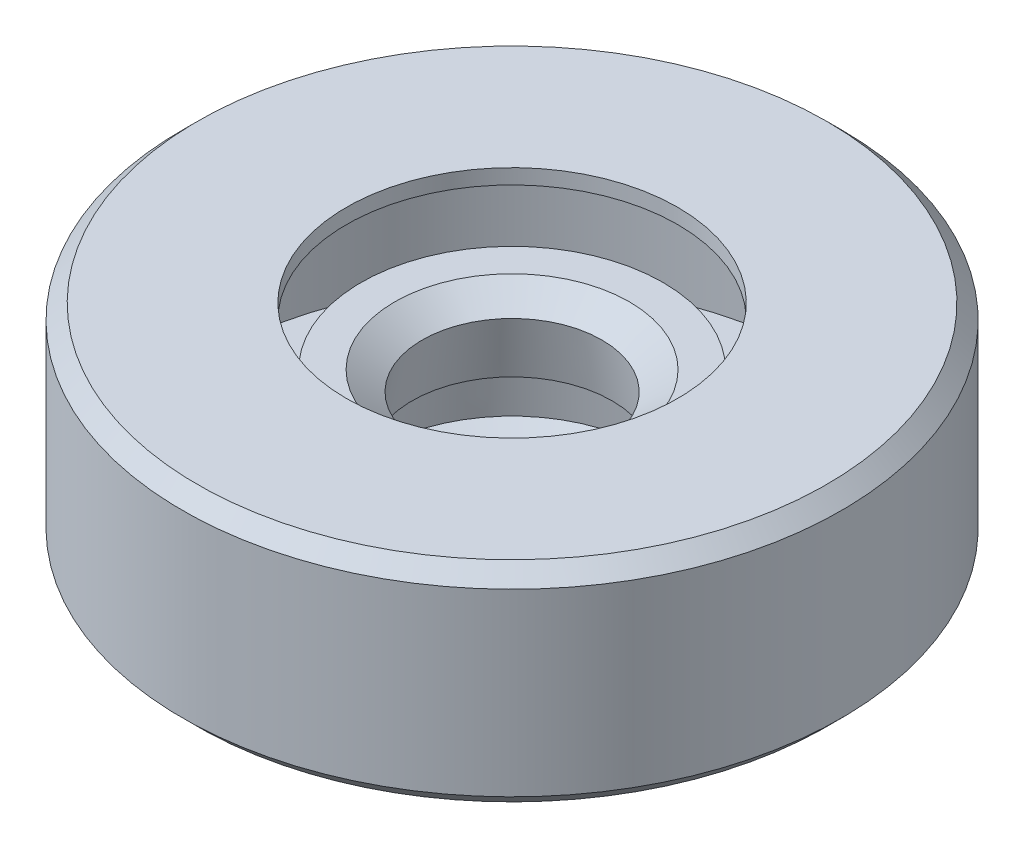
ISO-10303-21;
HEADER;
FILE_DESCRIPTION(('STEP AP214'),'2;1');
FILE_NAME('part.step','',(''),(''),'','','');
FILE_SCHEMA(('AUTOMOTIVE_DESIGN { 1 0 10303 214 1 1 1 1 }'));
ENDSEC;
DATA;
#1=APPLICATION_CONTEXT('core data for automotive mechanical design processes');
#2=APPLICATION_PROTOCOL_DEFINITION('international standard','automotive_design',2000,#1);
#3=PRODUCT_CONTEXT('',#1,'mechanical');
#4=PRODUCT('Part','Part','',(#3));
#5=PRODUCT_RELATED_PRODUCT_CATEGORY('part','',(#4));
#6=PRODUCT_DEFINITION_FORMATION('','',#4);
#7=PRODUCT_DEFINITION_CONTEXT('part definition',#1,'design');
#8=PRODUCT_DEFINITION('design','',#6,#7);
#9=PRODUCT_DEFINITION_SHAPE('','',#8);
#10=(LENGTH_UNIT() NAMED_UNIT(*) SI_UNIT(.MILLI.,.METRE.));
#11=(NAMED_UNIT(*) PLANE_ANGLE_UNIT() SI_UNIT($,.RADIAN.));
#12=(NAMED_UNIT(*) SI_UNIT($,.STERADIAN.) SOLID_ANGLE_UNIT());
#13=UNCERTAINTY_MEASURE_WITH_UNIT(LENGTH_MEASURE(1.E-05),#10,'distance_accuracy_value','');
#14=(GEOMETRIC_REPRESENTATION_CONTEXT(3) GLOBAL_UNCERTAINTY_ASSIGNED_CONTEXT((#13)) GLOBAL_UNIT_ASSIGNED_CONTEXT((#10,
#11,#12)) REPRESENTATION_CONTEXT('',''));
#15=CARTESIAN_POINT('',(0.,0.,0.));
#16=DIRECTION('',(0.,0.,1.));
#17=DIRECTION('',(1.,0.,0.));
#18=AXIS2_PLACEMENT_3D('',#15,#16,#17);
#19=CARTESIAN_POINT('',(0.,3.55064134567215,0.));
#20=DIRECTION('',(0.,-1.,0.));
#21=DIRECTION('',(0.,0.,-1.));
#22=AXIS2_PLACEMENT_3D('',#19,#20,#21);
#23=TOROIDAL_SURFACE('',#22,4.83888237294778,0.447213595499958);
#24=CARTESIAN_POINT('',(0.,3.1034277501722,0.));
#25=DIRECTION('',(0.,-1.,0.));
#26=DIRECTION('',(0.,0.,-1.));
#27=AXIS2_PLACEMENT_3D('',#24,#25,#26);
#28=CIRCLE('',#27,4.83888237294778);
#29=CARTESIAN_POINT('',(0.,3.1034277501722,-4.83888237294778));
#30=VERTEX_POINT('',#29);
#31=EDGE_CURVE('E10',#30,#30,#28,.T.);
#32=ORIENTED_EDGE('',*,*,#31,.F.);
#33=EDGE_LOOP('',(#32));
#34=FACE_BOUND('',#33,.T.);
#35=CARTESIAN_POINT('',(0.,3.95064134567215,0.));
#36=DIRECTION('',(0.,-1.,0.));
#37=DIRECTION('',(0.,0.,-1.));
#38=AXIS2_PLACEMENT_3D('',#35,#36,#37);
#39=CIRCLE('',#38,5.03888237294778);
#40=CARTESIAN_POINT('',(0.,3.95064134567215,-5.03888237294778));
#41=VERTEX_POINT('',#40);
#42=EDGE_CURVE('E99',#41,#41,#39,.T.);
#43=ORIENTED_EDGE('',*,*,#42,.T.);
#44=EDGE_LOOP('',(#43));
#45=FACE_BOUND('',#44,.T.);
#46=ADVANCED_FACE('F29',(#34,#45),#23,.T.);
#47=CARTESIAN_POINT('',(0.,3.1034277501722,0.));
#48=DIRECTION('',(0.,-1.,0.));
#49=DIRECTION('',(0.,0.,-1.));
#50=AXIS2_PLACEMENT_3D('',#47,#48,#49);
#51=CONICAL_SURFACE('',#50,4.83888237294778,0.0872664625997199);
#52=CARTESIAN_POINT('',(0.,0.933012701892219,0.));
#53=DIRECTION('',(0.,-1.,0.));
#54=DIRECTION('',(0.,0.,-1.));
#55=AXIS2_PLACEMENT_3D('',#52,#53,#54);
#56=CIRCLE('',#55,5.02876908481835);
#57=CARTESIAN_POINT('',(0.,0.933012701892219,-5.02876908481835));
#58=VERTEX_POINT('',#57);
#59=EDGE_CURVE('E35',#58,#58,#56,.T.);
#60=ORIENTED_EDGE('',*,*,#59,.F.);
#61=EDGE_LOOP('',(#60));
#62=FACE_BOUND('',#61,.T.);
#63=ORIENTED_EDGE('',*,*,#31,.T.);
#64=EDGE_LOOP('',(#63));
#65=FACE_BOUND('',#64,.T.);
#66=ADVANCED_FACE('F220',(#62,#65),#51,.T.);
#67=CARTESIAN_POINT('',(-5.52876908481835,0.933012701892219,0.));
#68=DIRECTION('',(0.,-1.,0.));
#69=DIRECTION('',(0.,0.,-1.));
#70=AXIS2_PLACEMENT_3D('',#67,#68,#69);
#71=PLANE('',#70);
#72=CARTESIAN_POINT('',(0.,0.933012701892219,0.));
#73=DIRECTION('',(0.,-1.,0.));
#74=DIRECTION('',(0.,0.,-1.));
#75=AXIS2_PLACEMENT_3D('',#72,#73,#74);
#76=CIRCLE('',#75,5.52876908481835);
#77=CARTESIAN_POINT('',(0.,0.933012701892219,-5.52876908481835));
#78=VERTEX_POINT('',#77);
#79=EDGE_CURVE('E39',#78,#78,#76,.T.);
#80=ORIENTED_EDGE('',*,*,#79,.F.);
#81=EDGE_LOOP('',(#80));
#82=FACE_BOUND('',#81,.T.);
#83=ORIENTED_EDGE('',*,*,#59,.T.);
#84=EDGE_LOOP('',(#83));
#85=FACE_BOUND('',#84,.T.);
#86=ADVANCED_FACE('F215',(#82,#85),#71,.F.);
#87=CARTESIAN_POINT('',(0.,0.933012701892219,0.));
#88=DIRECTION('',(0.,-1.,0.));
#89=DIRECTION('',(0.,0.,-1.));
#90=AXIS2_PLACEMENT_3D('',#87,#88,#89);
#91=CONICAL_SURFACE('',#90,5.52876908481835,0.523598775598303);
#92=CARTESIAN_POINT('',(0.,0.5,0.));
#93=DIRECTION('',(0.,-1.,0.));
#94=DIRECTION('',(0.,0.,-1.));
#95=AXIS2_PLACEMENT_3D('',#92,#93,#94);
#96=CIRCLE('',#95,5.77876908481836);
#97=CARTESIAN_POINT('',(0.,0.5,-5.77876908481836));
#98=VERTEX_POINT('',#97);
#99=EDGE_CURVE('E43',#98,#98,#96,.T.);
#100=ORIENTED_EDGE('',*,*,#99,.F.);
#101=EDGE_LOOP('',(#100));
#102=FACE_BOUND('',#101,.T.);
#103=ORIENTED_EDGE('',*,*,#79,.T.);
#104=EDGE_LOOP('',(#103));
#105=FACE_BOUND('',#104,.T.);
#106=ADVANCED_FACE('F209',(#102,#105),#91,.T.);
#107=CARTESIAN_POINT('',(-10.,0.5,0.));
#108=DIRECTION('',(0.,-1.,0.));
#109=DIRECTION('',(0.,0.,-1.));
#110=AXIS2_PLACEMENT_3D('',#107,#108,#109);
#111=PLANE('',#110);
#112=CARTESIAN_POINT('',(0.,0.499999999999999,0.));
#113=DIRECTION('',(0.,-1.,0.));
#114=DIRECTION('',(0.,0.,-1.));
#115=AXIS2_PLACEMENT_3D('',#112,#113,#114);
#116=CIRCLE('',#115,10.);
#117=CARTESIAN_POINT('',(0.,0.499999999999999,-10.));
#118=VERTEX_POINT('',#117);
#119=EDGE_CURVE('E48',#118,#118,#116,.T.);
#120=ORIENTED_EDGE('',*,*,#119,.F.);
#121=EDGE_LOOP('',(#120));
#122=FACE_BOUND('',#121,.T.);
#123=ORIENTED_EDGE('',*,*,#99,.T.);
#124=EDGE_LOOP('',(#123));
#125=FACE_BOUND('',#124,.T.);
#126=ADVANCED_FACE('F203',(#122,#125),#111,.F.);
#127=CARTESIAN_POINT('',(0.,0.,0.));
#128=DIRECTION('',(0.,-1.,0.));
#129=DIRECTION('',(0.,0.,-1.));
#130=AXIS2_PLACEMENT_3D('',#127,#128,#129);
#131=CYLINDRICAL_SURFACE('',#130,10.);
#132=CARTESIAN_POINT('',(0.,6.5,0.));
#133=DIRECTION('',(0.,-1.,0.));
#134=DIRECTION('',(0.,0.,-1.));
#135=AXIS2_PLACEMENT_3D('',#132,#133,#134);
#136=CIRCLE('',#135,10.);
#137=CARTESIAN_POINT('',(0.,6.5,-10.));
#138=VERTEX_POINT('',#137);
#139=EDGE_CURVE('E51',#138,#138,#136,.T.);
#140=ORIENTED_EDGE('',*,*,#139,.F.);
#141=EDGE_LOOP('',(#140));
#142=FACE_BOUND('',#141,.T.);
#143=ORIENTED_EDGE('',*,*,#119,.T.);
#144=EDGE_LOOP('',(#143));
#145=FACE_BOUND('',#144,.T.);
#146=ADVANCED_FACE('F197',(#142,#145),#131,.F.);
#147=CARTESIAN_POINT('',(-10.,6.5,0.));
#148=DIRECTION('',(0.,1.,0.));
#149=DIRECTION('',(0.,0.,1.));
#150=AXIS2_PLACEMENT_3D('',#147,#148,#149);
#151=PLANE('',#150);
#152=CARTESIAN_POINT('',(0.,6.5,0.));
#153=DIRECTION('',(0.,-1.,0.));
#154=DIRECTION('',(0.,0.,-1.));
#155=AXIS2_PLACEMENT_3D('',#152,#153,#154);
#156=CIRCLE('',#155,5.52876908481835);
#157=CARTESIAN_POINT('',(0.,6.5,-5.52876908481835));
#158=VERTEX_POINT('',#157);
#159=EDGE_CURVE('E54',#158,#158,#156,.T.);
#160=ORIENTED_EDGE('',*,*,#159,.F.);
#161=EDGE_LOOP('',(#160));
#162=FACE_BOUND('',#161,.T.);
#163=ORIENTED_EDGE('',*,*,#139,.T.);
#164=EDGE_LOOP('',(#163));
#165=FACE_BOUND('',#164,.T.);
#166=ADVANCED_FACE('F191',(#162,#165),#151,.F.);
#167=CARTESIAN_POINT('',(0.,0.,0.));
#168=DIRECTION('',(0.,-1.,0.));
#169=DIRECTION('',(0.,0.,-1.));
#170=AXIS2_PLACEMENT_3D('',#167,#168,#169);
#171=CYLINDRICAL_SURFACE('',#170,5.52876908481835);
#172=CARTESIAN_POINT('',(0.,7.,0.));
#173=DIRECTION('',(0.,-1.,0.));
#174=DIRECTION('',(0.,0.,-1.));
#175=AXIS2_PLACEMENT_3D('',#172,#173,#174);
#176=CIRCLE('',#175,5.52876908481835);
#177=CARTESIAN_POINT('',(0.,7.,-5.52876908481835));
#178=VERTEX_POINT('',#177);
#179=EDGE_CURVE('E57',#178,#178,#176,.T.);
#180=ORIENTED_EDGE('',*,*,#179,.F.);
#181=EDGE_LOOP('',(#180));
#182=FACE_BOUND('',#181,.T.);
#183=ORIENTED_EDGE('',*,*,#159,.T.);
#184=EDGE_LOOP('',(#183));
#185=FACE_BOUND('',#184,.T.);
#186=ADVANCED_FACE('F185',(#182,#185),#171,.F.);
#187=CARTESIAN_POINT('',(-10.5,7.,0.));
#188=DIRECTION('',(0.,-1.,0.));
#189=DIRECTION('',(0.,0.,-1.));
#190=AXIS2_PLACEMENT_3D('',#187,#188,#189);
#191=PLANE('',#190);
#192=CARTESIAN_POINT('',(0.,7.,0.));
#193=DIRECTION('',(0.,-1.,0.));
#194=DIRECTION('',(0.,0.,-1.));
#195=AXIS2_PLACEMENT_3D('',#192,#193,#194);
#196=CIRCLE('',#195,10.5);
#197=CARTESIAN_POINT('',(0.,7.,-10.5));
#198=VERTEX_POINT('',#197);
#199=EDGE_CURVE('E60',#198,#198,#196,.T.);
#200=ORIENTED_EDGE('',*,*,#199,.F.);
#201=EDGE_LOOP('',(#200));
#202=FACE_BOUND('',#201,.T.);
#203=ORIENTED_EDGE('',*,*,#179,.T.);
#204=EDGE_LOOP('',(#203));
#205=FACE_BOUND('',#204,.T.);
#206=ADVANCED_FACE('F179',(#202,#205),#191,.F.);
#207=CARTESIAN_POINT('',(0.,7.,0.));
#208=DIRECTION('',(0.,-1.,0.));
#209=DIRECTION('',(0.,0.,-1.));
#210=AXIS2_PLACEMENT_3D('',#207,#208,#209);
#211=CONICAL_SURFACE('',#210,10.5,0.785398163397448);
#212=CARTESIAN_POINT('',(0.,6.5,0.));
#213=DIRECTION('',(0.,-1.,0.));
#214=DIRECTION('',(0.,0.,-1.));
#215=AXIS2_PLACEMENT_3D('',#212,#213,#214);
#216=CIRCLE('',#215,11.);
#217=CARTESIAN_POINT('',(0.,6.5,-11.));
#218=VERTEX_POINT('',#217);
#219=EDGE_CURVE('E63',#218,#218,#216,.T.);
#220=ORIENTED_EDGE('',*,*,#219,.F.);
#221=EDGE_LOOP('',(#220));
#222=FACE_BOUND('',#221,.T.);
#223=ORIENTED_EDGE('',*,*,#199,.T.);
#224=EDGE_LOOP('',(#223));
#225=FACE_BOUND('',#224,.T.);
#226=ADVANCED_FACE('F173',(#222,#225),#211,.T.);
#227=CARTESIAN_POINT('',(0.,0.,0.));
#228=DIRECTION('',(0.,-1.,0.));
#229=DIRECTION('',(0.,0.,-1.));
#230=AXIS2_PLACEMENT_3D('',#227,#228,#229);
#231=CYLINDRICAL_SURFACE('',#230,11.);
#232=CARTESIAN_POINT('',(0.,0.499999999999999,0.));
#233=DIRECTION('',(0.,-1.,0.));
#234=DIRECTION('',(0.,0.,-1.));
#235=AXIS2_PLACEMENT_3D('',#232,#233,#234);
#236=CIRCLE('',#235,11.);
#237=CARTESIAN_POINT('',(0.,0.499999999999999,-11.));
#238=VERTEX_POINT('',#237);
#239=EDGE_CURVE('E66',#238,#238,#236,.T.);
#240=ORIENTED_EDGE('',*,*,#239,.F.);
#241=EDGE_LOOP('',(#240));
#242=FACE_BOUND('',#241,.T.);
#243=ORIENTED_EDGE('',*,*,#219,.T.);
#244=EDGE_LOOP('',(#243));
#245=FACE_BOUND('',#244,.T.);
#246=ADVANCED_FACE('F167',(#242,#245),#231,.T.);
#247=CARTESIAN_POINT('',(0.,0.499999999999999,0.));
#248=DIRECTION('',(0.,1.,0.));
#249=DIRECTION('',(0.,0.,1.));
#250=AXIS2_PLACEMENT_3D('',#247,#248,#249);
#251=CONICAL_SURFACE('',#250,11.,0.785398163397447);
#252=CARTESIAN_POINT('',(0.,0.,0.));
#253=DIRECTION('',(0.,-1.,0.));
#254=DIRECTION('',(0.,0.,-1.));
#255=AXIS2_PLACEMENT_3D('',#252,#253,#254);
#256=CIRCLE('',#255,10.5);
#257=CARTESIAN_POINT('',(0.,0.,-10.5));
#258=VERTEX_POINT('',#257);
#259=EDGE_CURVE('E69',#258,#258,#256,.T.);
#260=ORIENTED_EDGE('',*,*,#259,.F.);
#261=EDGE_LOOP('',(#260));
#262=FACE_BOUND('',#261,.T.);
#263=ORIENTED_EDGE('',*,*,#239,.T.);
#264=EDGE_LOOP('',(#263));
#265=FACE_BOUND('',#264,.T.);
#266=ADVANCED_FACE('F161',(#262,#265),#251,.T.);
#267=CARTESIAN_POINT('',(-10.5,0.,0.));
#268=DIRECTION('',(0.,1.,0.));
#269=DIRECTION('',(0.,0.,1.));
#270=AXIS2_PLACEMENT_3D('',#267,#268,#269);
#271=PLANE('',#270);
#272=CARTESIAN_POINT('',(0.,0.,0.));
#273=DIRECTION('',(0.,-1.,0.));
#274=DIRECTION('',(0.,0.,-1.));
#275=AXIS2_PLACEMENT_3D('',#272,#273,#274);
#276=CIRCLE('',#275,5.00848720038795);
#277=CARTESIAN_POINT('',(0.,0.,-5.00848720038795));
#278=VERTEX_POINT('',#277);
#279=EDGE_CURVE('E72',#278,#278,#276,.T.);
#280=ORIENTED_EDGE('',*,*,#279,.F.);
#281=EDGE_LOOP('',(#280));
#282=FACE_BOUND('',#281,.T.);
#283=ORIENTED_EDGE('',*,*,#259,.T.);
#284=EDGE_LOOP('',(#283));
#285=FACE_BOUND('',#284,.T.);
#286=ADVANCED_FACE('F155',(#282,#285),#271,.F.);
#287=CARTESIAN_POINT('',(0.,-0.116666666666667,0.));
#288=DIRECTION('',(0.,-1.,0.));
#289=DIRECTION('',(0.,0.,-1.));
#290=AXIS2_PLACEMENT_3D('',#287,#288,#289);
#291=TOROIDAL_SURFACE('',#290,4.60848720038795,0.416666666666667);
#292=CARTESIAN_POINT('',(0.,0.,0.));
#293=DIRECTION('',(0.,-1.,0.));
#294=DIRECTION('',(0.,0.,-1.));
#295=AXIS2_PLACEMENT_3D('',#292,#293,#294);
#296=CIRCLE('',#295,4.20848720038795);
#297=CARTESIAN_POINT('',(0.,0.,-4.20848720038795));
#298=VERTEX_POINT('',#297);
#299=EDGE_CURVE('E75',#298,#298,#296,.T.);
#300=ORIENTED_EDGE('',*,*,#299,.F.);
#301=EDGE_LOOP('',(#300));
#302=FACE_BOUND('',#301,.T.);
#303=ORIENTED_EDGE('',*,*,#279,.T.);
#304=EDGE_LOOP('',(#303));
#305=FACE_BOUND('',#304,.T.);
#306=ADVANCED_FACE('F149',(#302,#305),#291,.F.);
#307=CARTESIAN_POINT('',(0.,0.,0.));
#308=DIRECTION('',(0.,-1.,0.));
#309=DIRECTION('',(0.,0.,-1.));
#310=AXIS2_PLACEMENT_3D('',#307,#308,#309);
#311=CONICAL_SURFACE('',#310,4.20848720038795,1.48352986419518);
#312=CARTESIAN_POINT('',(0.,0.0759776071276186,0.));
#313=DIRECTION('',(0.,-1.,0.));
#314=DIRECTION('',(0.,0.,-1.));
#315=AXIS2_PLACEMENT_3D('',#312,#313,#314);
#316=CIRCLE('',#315,3.34005917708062);
#317=CARTESIAN_POINT('',(0.,0.0759776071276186,-3.34005917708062));
#318=VERTEX_POINT('',#317);
#319=EDGE_CURVE('E78',#318,#318,#316,.T.);
#320=ORIENTED_EDGE('',*,*,#319,.F.);
#321=EDGE_LOOP('',(#320));
#322=FACE_BOUND('',#321,.T.);
#323=ORIENTED_EDGE('',*,*,#299,.T.);
#324=EDGE_LOOP('',(#323));
#325=FACE_BOUND('',#324,.T.);
#326=ADVANCED_FACE('F143',(#322,#325),#311,.F.);
#327=CARTESIAN_POINT('',(0.,0.0759776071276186,0.));
#328=DIRECTION('',(0.,1.,0.));
#329=DIRECTION('',(0.,0.,1.));
#330=AXIS2_PLACEMENT_3D('',#327,#328,#329);
#331=CONICAL_SURFACE('',#330,3.34005917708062,1.23748390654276);
#332=CARTESIAN_POINT('',(0.,0.500000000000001,0.));
#333=DIRECTION('',(0.,-1.,0.));
#334=DIRECTION('',(0.,0.,-1.));
#335=AXIS2_PLACEMENT_3D('',#332,#333,#334);
#336=CIRCLE('',#335,4.56474286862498);
#337=CARTESIAN_POINT('',(0.,0.500000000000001,-4.56474286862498));
#338=VERTEX_POINT('',#337);
#339=EDGE_CURVE('E81',#338,#338,#336,.T.);
#340=ORIENTED_EDGE('',*,*,#339,.F.);
#341=EDGE_LOOP('',(#340));
#342=FACE_BOUND('',#341,.T.);
#343=ORIENTED_EDGE('',*,*,#319,.T.);
#344=EDGE_LOOP('',(#343));
#345=FACE_BOUND('',#344,.T.);
#346=ADVANCED_FACE('F137',(#342,#345),#331,.F.);
#347=CARTESIAN_POINT('',(0.,0.500000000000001,0.));
#348=DIRECTION('',(0.,-1.,0.));
#349=DIRECTION('',(0.,0.,-1.));
#350=AXIS2_PLACEMENT_3D('',#347,#348,#349);
#351=CONICAL_SURFACE('',#350,4.56474286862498,0.0872664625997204);
#352=CARTESIAN_POINT('',(0.,2.5,0.));
#353=DIRECTION('',(0.,-1.,0.));
#354=DIRECTION('',(0.,0.,-1.));
#355=AXIS2_PLACEMENT_3D('',#352,#353,#354);
#356=CIRCLE('',#355,4.38976554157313);
#357=CARTESIAN_POINT('',(0.,2.5,-4.38976554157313));
#358=VERTEX_POINT('',#357);
#359=EDGE_CURVE('E84',#358,#358,#356,.T.);
#360=ORIENTED_EDGE('',*,*,#359,.F.);
#361=EDGE_LOOP('',(#360));
#362=FACE_BOUND('',#361,.T.);
#363=ORIENTED_EDGE('',*,*,#339,.T.);
#364=EDGE_LOOP('',(#363));
#365=FACE_BOUND('',#364,.T.);
#366=ADVANCED_FACE('F131',(#362,#365),#351,.F.);
#367=CARTESIAN_POINT('',(-3.34005917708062,2.5,0.));
#368=DIRECTION('',(0.,1.,0.));
#369=DIRECTION('',(0.,0.,1.));
#370=AXIS2_PLACEMENT_3D('',#367,#368,#369);
#371=PLANE('',#370);
#372=CARTESIAN_POINT('',(0.,2.5,0.));
#373=DIRECTION('',(0.,-1.,0.));
#374=DIRECTION('',(0.,0.,-1.));
#375=AXIS2_PLACEMENT_3D('',#372,#373,#374);
#376=CIRCLE('',#375,3.34005917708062);
#377=CARTESIAN_POINT('',(0.,2.5,-3.34005917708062));
#378=VERTEX_POINT('',#377);
#379=EDGE_CURVE('E87',#378,#378,#376,.T.);
#380=ORIENTED_EDGE('',*,*,#379,.F.);
#381=EDGE_LOOP('',(#380));
#382=FACE_BOUND('',#381,.T.);
#383=ORIENTED_EDGE('',*,*,#359,.T.);
#384=EDGE_LOOP('',(#383));
#385=FACE_BOUND('',#384,.T.);
#386=ADVANCED_FACE('F125',(#382,#385),#371,.F.);
#387=CARTESIAN_POINT('',(0.,2.5,0.));
#388=DIRECTION('',(0.,-1.,0.));
#389=DIRECTION('',(0.,0.,-1.));
#390=AXIS2_PLACEMENT_3D('',#387,#388,#389);
#391=CONICAL_SURFACE('',#390,3.34005917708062,0.174532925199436);
#392=CARTESIAN_POINT('',(0.,4.42857142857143,0.));
#393=DIRECTION('',(0.,-1.,0.));
#394=DIRECTION('',(0.,0.,-1.));
#395=AXIS2_PLACEMENT_3D('',#392,#393,#394);
#396=CIRCLE('',#395,3.);
#397=CARTESIAN_POINT('',(0.,4.42857142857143,-3.));
#398=VERTEX_POINT('',#397);
#399=EDGE_CURVE('E90',#398,#398,#396,.T.);
#400=ORIENTED_EDGE('',*,*,#399,.F.);
#401=EDGE_LOOP('',(#400));
#402=FACE_BOUND('',#401,.T.);
#403=ORIENTED_EDGE('',*,*,#379,.T.);
#404=EDGE_LOOP('',(#403));
#405=FACE_BOUND('',#404,.T.);
#406=ADVANCED_FACE('F119',(#402,#405),#391,.F.);
#407=CARTESIAN_POINT('',(0.,4.42857142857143,0.));
#408=DIRECTION('',(0.,1.,0.));
#409=DIRECTION('',(0.,0.,1.));
#410=AXIS2_PLACEMENT_3D('',#407,#408,#409);
#411=CONICAL_SURFACE('',#410,3.,0.95993108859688);
#412=CARTESIAN_POINT('',(0.,5.07142857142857,0.));
#413=DIRECTION('',(0.,-1.,0.));
#414=DIRECTION('',(0.,0.,-1.));
#415=AXIS2_PLACEMENT_3D('',#412,#413,#414);
#416=CIRCLE('',#415,3.91809514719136);
#417=CARTESIAN_POINT('',(0.,5.07142857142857,-3.91809514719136));
#418=VERTEX_POINT('',#417);
#419=EDGE_CURVE('E93',#418,#418,#416,.T.);
#420=ORIENTED_EDGE('',*,*,#419,.F.);
#421=EDGE_LOOP('',(#420));
#422=FACE_BOUND('',#421,.T.);
#423=ORIENTED_EDGE('',*,*,#399,.T.);
#424=EDGE_LOOP('',(#423));
#425=FACE_BOUND('',#424,.T.);
#426=ADVANCED_FACE('F113',(#422,#425),#411,.F.);
#427=CARTESIAN_POINT('',(-3.91809514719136,5.07142857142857,0.));
#428=DIRECTION('',(0.,-1.,0.));
#429=DIRECTION('',(0.,0.,-1.));
#430=AXIS2_PLACEMENT_3D('',#427,#428,#429);
#431=PLANE('',#430);
#432=CARTESIAN_POINT('',(0.,5.07142857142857,0.));
#433=DIRECTION('',(0.,-1.,0.));
#434=DIRECTION('',(0.,0.,-1.));
#435=AXIS2_PLACEMENT_3D('',#432,#433,#434);
#436=CIRCLE('',#435,5.03888237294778);
#437=CARTESIAN_POINT('',(0.,5.07142857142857,-5.03888237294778));
#438=VERTEX_POINT('',#437);
#439=EDGE_CURVE('E96',#438,#438,#436,.T.);
#440=ORIENTED_EDGE('',*,*,#439,.F.);
#441=EDGE_LOOP('',(#440));
#442=FACE_BOUND('',#441,.T.);
#443=ORIENTED_EDGE('',*,*,#419,.T.);
#444=EDGE_LOOP('',(#443));
#445=FACE_BOUND('',#444,.T.);
#446=ADVANCED_FACE('F107',(#442,#445),#431,.F.);
#447=CARTESIAN_POINT('',(0.,0.,0.));
#448=DIRECTION('',(0.,-1.,0.));
#449=DIRECTION('',(0.,0.,-1.));
#450=AXIS2_PLACEMENT_3D('',#447,#448,#449);
#451=CYLINDRICAL_SURFACE('',#450,5.03888237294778);
#452=ORIENTED_EDGE('',*,*,#42,.F.);
#453=EDGE_LOOP('',(#452));
#454=FACE_BOUND('',#453,.T.);
#455=ORIENTED_EDGE('',*,*,#439,.T.);
#456=EDGE_LOOP('',(#455));
#457=FACE_BOUND('',#456,.T.);
#458=ADVANCED_FACE('F104',(#454,#457),#451,.T.);
#459=CLOSED_SHELL('',(#46,#66,#86,#106,#126,#146,#166,#186,#206,#226,#246,#266,#286,#306,#326,
#346,#366,#386,#406,#426,#446,#458));
#460=MANIFOLD_SOLID_BREP('B2',#459);
#461=ADVANCED_BREP_SHAPE_REPRESENTATION('',(#18,#460),#14);
#462=SHAPE_DEFINITION_REPRESENTATION(#9,#461);
ENDSEC;
END-ISO-10303-21;
